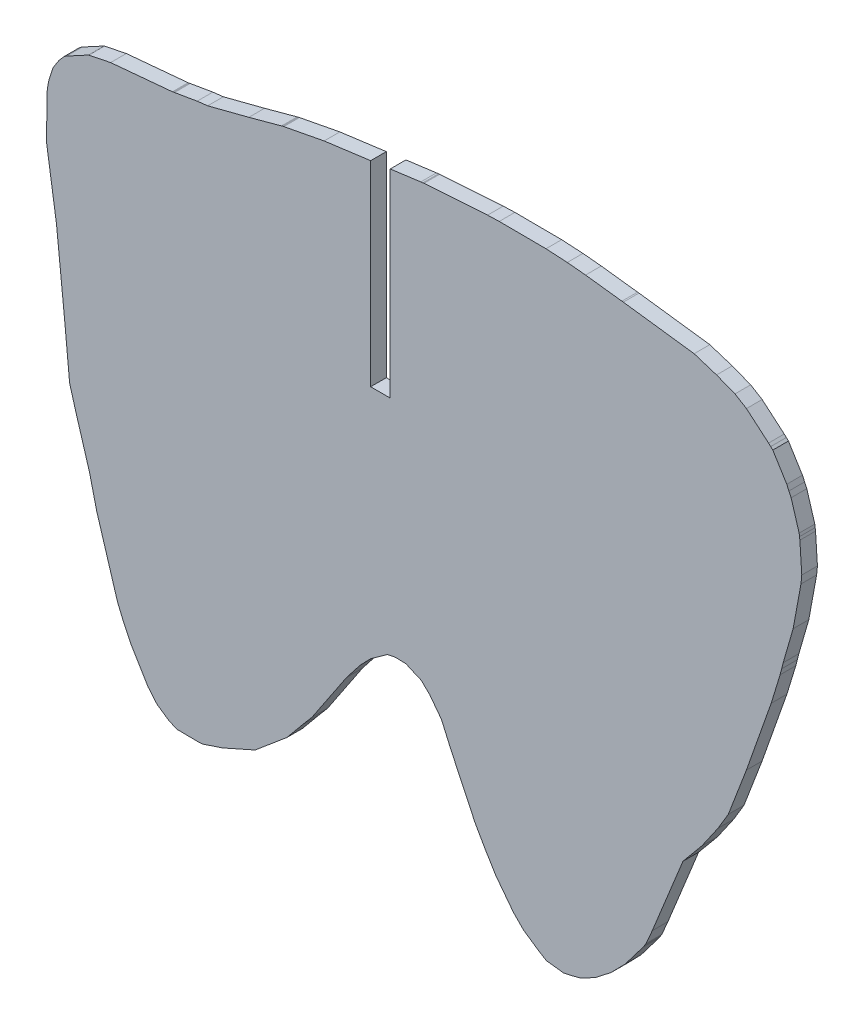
from build123d import *

# Parameters (mm, degrees)
EXTRUDE_1_DEPTH = 2


with BuildPart() as part:
    # Model → Extrude 1 (new body)
    with BuildSketch(Plane.XY):
        Polygon((-6235.5982, 41.9604), (-6235.6612, 41.9386), (-6238.4369, 40.4371), (-6238.5915, 40.3384), (-6238.7461, 40.2397), (-6239.4378, 39.4428), (-6239.8036, 38.8664), (-6240.1696, 38.29), (-6240.4391, 37.4668), (-6240.7088, 36.6436), (-6240.9129, 35.565), (-6241.0031, 30.697), (-6241.0036, 29.7834), (-6240.9936, 29.6234), (-6240.9837, 29.4635), (-6239.738, 21.2436), (-6238.7133, 11.3128), (-6238.0612, 4.4888), (-6237.277, 1.7348), (-6235.5126, -4.1362), (-6234.5976, -7.9595), (-6231.9546, -16.6264), (-6231.1498, -18.5551), (-6230.2179, -20.4938), (-6228.0356, -24.11), (-6226.8904, -25.4591), (-6225.4163, -26.4666), (-6224.4118, -26.9352), (-6221.4727, -26.9715), (-6221.4487, -26.9558), (-6221.4247, -26.9403), (-6221.1011, -26.9371), (-6218.5417, -26.085), (-6214.391, -24.2433), (-6214.3893, -24.2425), (-6214.3877, -24.2417), (-6214.3844, -24.2395), (-6214.381, -24.2372), (-6210.3383, -20.8347), (-6208.3222, -18.3984), (-6207.1222, -16.98), (-6202.7052, -10.3726), (-6200.9755, -8.1567), (-6199.6473, -6.7815), (-6197.5055, -5.2456), (-6196.4748, -5.0386), (-6195.1233, -5.0841), (-6193.9513, -5.61), (-6193.1955, -5.9263), (-6192.111, -6.9652), (-6190.5983, -8.9678), (-6189.414, -11.6641), (-6186.3141, -18.2414), (-6185.0726, -20.4302), (-6183.6814, -22.7249), (-6181.391, -25.7304), (-6180.1307, -27.0112), (-6178.2104, -28.3199), (-6177.2243, -28.933), (-6176.0262, -29.0719), (-6175.0688, -29.2001), (-6173.8403, -28.9381), (-6172.858, -28.6748), (-6170.9992, -27.7061), (-6168.9512, -26.1184), (-6167.1227, -24.2421), (-6164.8326, -21.2258), (-6164.6586, -20.9507), (-6164.4845, -20.6756), (-6163.6996, -18.8669), (-6159.7782, -9.2284), (-6157.3643, -6.3177), (-6155.3017, -3.3414), (-6153.9913, -1.1466), (-6151.6836, 4.8912), (-6148.5182, 13.8629), (-6147.3837, 17.5757), (-6147.1869, 18.3381), (-6146.9903, 19.1005), (-6145.7166, 23.5069), (-6144.7184, 28.9464), (-6144.6164, 29.989), (-6144.8578, 33.72), (-6144.9047, 34.086), (-6144.9517, 34.4519), (-6145.9756, 37.8528), (-6146.2536, 38.4603), (-6146.5314, 39.0678), (-6148.3145, 41.9499), (-6148.5854, 42.2025), (-6148.8564, 42.4551), (-6151.6764, 44.859), (-6153.1432, 45.7476), (-6155.4933, 46.6657), (-6158.3548, 47.5821), (-6167.3902, 48.7643), (-6167.5726, 48.7786), (-6172.2104, 49.3466), (-6174.5433, 49.5741), (-6177.2615, 49.7296), (-6183.2293, 49.7653), (-6184.7176, 49.7152), (-6192.8404, 49.1711), (-6192.9084, 49.1649), (-6192.9765, 49.1587), (-6193.2382, 49.128), (-6197.1419, 48.6088), (-6197.1419, 23.2852), (-6197.3919, 23.2852), (-6199.3919, 23.2852), (-6199.6419, 23.2852), (-6199.6419, 48.2761), (-6205.5748, 47.487), (-6210.7258, 46.4992), (-6210.8371, 46.4778), (-6210.9483, 46.4564), (-6210.9809, 46.4415), (-6211.0136, 46.4267), (-6215.1836, 45.2961), (-6220.4397, 43.9389), (-6221.7803, 43.7822), (-6224.6756, 43.2913), (-6224.8078, 43.2661), (-6224.9401, 43.2409), (-6232.8252, 42.5248), align=None)
    extrude(amount=EXTRUDE_1_DEPTH)


solid = part.part
